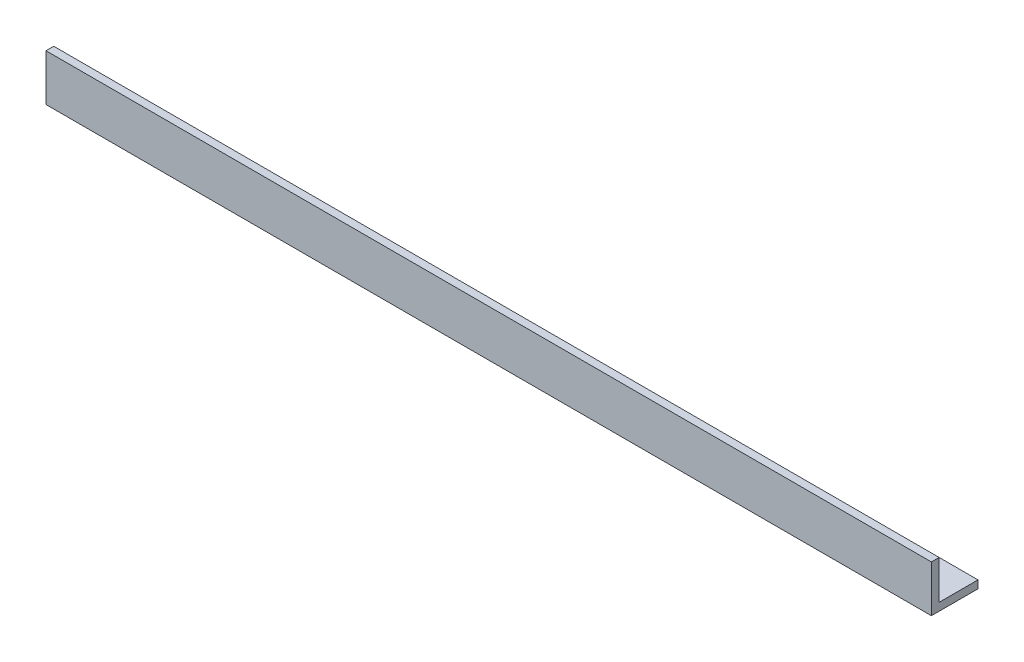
ISO-10303-21;
HEADER;
FILE_DESCRIPTION(('STEP AP214'),'2;1');
FILE_NAME('part.step','',(''),(''),'','','');
FILE_SCHEMA(('AUTOMOTIVE_DESIGN { 1 0 10303 214 1 1 1 1 }'));
ENDSEC;
DATA;
#1=APPLICATION_CONTEXT('core data for automotive mechanical design processes');
#2=APPLICATION_PROTOCOL_DEFINITION('international standard','automotive_design',2000,#1);
#3=PRODUCT_CONTEXT('',#1,'mechanical');
#4=PRODUCT('Part','Part','',(#3));
#5=PRODUCT_RELATED_PRODUCT_CATEGORY('part','',(#4));
#6=PRODUCT_DEFINITION_FORMATION('','',#4);
#7=PRODUCT_DEFINITION_CONTEXT('part definition',#1,'design');
#8=PRODUCT_DEFINITION('design','',#6,#7);
#9=PRODUCT_DEFINITION_SHAPE('','',#8);
#10=(LENGTH_UNIT() NAMED_UNIT(*) SI_UNIT(.MILLI.,.METRE.));
#11=(NAMED_UNIT(*) PLANE_ANGLE_UNIT() SI_UNIT($,.RADIAN.));
#12=(NAMED_UNIT(*) SI_UNIT($,.STERADIAN.) SOLID_ANGLE_UNIT());
#13=UNCERTAINTY_MEASURE_WITH_UNIT(LENGTH_MEASURE(1.E-05),#10,'distance_accuracy_value','');
#14=(GEOMETRIC_REPRESENTATION_CONTEXT(3) GLOBAL_UNCERTAINTY_ASSIGNED_CONTEXT((#13)) GLOBAL_UNIT_ASSIGNED_CONTEXT((#10,
#11,#12)) REPRESENTATION_CONTEXT('',''));
#15=CARTESIAN_POINT('',(0.,0.,0.));
#16=DIRECTION('',(0.,0.,1.));
#17=DIRECTION('',(1.,0.,0.));
#18=AXIS2_PLACEMENT_3D('',#15,#16,#17);
#19=CARTESIAN_POINT('',(723.9,0.,0.));
#20=DIRECTION('',(0.,1.,0.));
#21=DIRECTION('',(0.,0.,1.));
#22=AXIS2_PLACEMENT_3D('',#19,#20,#21);
#23=PLANE('',#22);
#24=DIRECTION('',(0.,0.,-1.));
#25=VECTOR('',#24,1.);
#26=CARTESIAN_POINT('',(0.,0.,0.));
#27=LINE('',#26,#25);
#28=CARTESIAN_POINT('',(0.,0.,0.));
#29=VERTEX_POINT('',#28);
#30=CARTESIAN_POINT('',(0.,0.,-38.1));
#31=VERTEX_POINT('',#30);
#32=EDGE_CURVE('E117',#29,#31,#27,.T.);
#33=ORIENTED_EDGE('',*,*,#32,.T.);
#34=DIRECTION('',(-1.,0.,0.));
#35=VECTOR('',#34,1.);
#36=CARTESIAN_POINT('',(723.9,0.,-38.1));
#37=LINE('',#36,#35);
#38=CARTESIAN_POINT('',(723.9,0.,-38.1));
#39=VERTEX_POINT('',#38);
#40=EDGE_CURVE('E11',#39,#31,#37,.T.);
#41=ORIENTED_EDGE('',*,*,#40,.F.);
#42=DIRECTION('',(0.,0.,-1.));
#43=VECTOR('',#42,1.);
#44=CARTESIAN_POINT('',(723.9,0.,0.));
#45=LINE('',#44,#43);
#46=CARTESIAN_POINT('',(723.9,0.,0.));
#47=VERTEX_POINT('',#46);
#48=EDGE_CURVE('E127',#47,#39,#45,.T.);
#49=ORIENTED_EDGE('',*,*,#48,.F.);
#50=DIRECTION('',(-1.,0.,0.));
#51=VECTOR('',#50,1.);
#52=CARTESIAN_POINT('',(723.9,0.,0.));
#53=LINE('',#52,#51);
#54=EDGE_CURVE('E113',#47,#29,#53,.T.);
#55=ORIENTED_EDGE('',*,*,#54,.T.);
#56=EDGE_LOOP('',(#33,#41,#49,#55));
#57=FACE_BOUND('',#56,.T.);
#58=ADVANCED_FACE('F33',(#57),#23,.F.);
#59=CARTESIAN_POINT('',(723.9,0.,-38.1));
#60=DIRECTION('',(0.,0.,1.));
#61=DIRECTION('',(1.,0.,0.));
#62=AXIS2_PLACEMENT_3D('',#59,#60,#61);
#63=PLANE('',#62);
#64=DIRECTION('',(0.,1.,0.));
#65=VECTOR('',#64,1.);
#66=CARTESIAN_POINT('',(0.,0.,-38.1));
#67=LINE('',#66,#65);
#68=CARTESIAN_POINT('',(0.,6.35,-38.1));
#69=VERTEX_POINT('',#68);
#70=EDGE_CURVE('E120',#31,#69,#67,.T.);
#71=ORIENTED_EDGE('',*,*,#70,.T.);
#72=DIRECTION('',(-1.,0.,0.));
#73=VECTOR('',#72,1.);
#74=CARTESIAN_POINT('',(723.9,6.35,-38.1));
#75=LINE('',#74,#73);
#76=CARTESIAN_POINT('',(723.9,6.35,-38.1));
#77=VERTEX_POINT('',#76);
#78=EDGE_CURVE('E41',#77,#69,#75,.T.);
#79=ORIENTED_EDGE('',*,*,#78,.F.);
#80=DIRECTION('',(0.,1.,0.));
#81=VECTOR('',#80,1.);
#82=CARTESIAN_POINT('',(723.9,0.,-38.1));
#83=LINE('',#82,#81);
#84=EDGE_CURVE('E86',#39,#77,#83,.T.);
#85=ORIENTED_EDGE('',*,*,#84,.F.);
#86=ORIENTED_EDGE('',*,*,#40,.T.);
#87=EDGE_LOOP('',(#71,#79,#85,#86));
#88=FACE_BOUND('',#87,.T.);
#89=ADVANCED_FACE('F151',(#88),#63,.F.);
#90=CARTESIAN_POINT('',(723.9,6.35,-38.1));
#91=DIRECTION('',(0.,-1.,0.));
#92=DIRECTION('',(0.,0.,-1.));
#93=AXIS2_PLACEMENT_3D('',#90,#91,#92);
#94=PLANE('',#93);
#95=DIRECTION('',(0.,0.,1.));
#96=VECTOR('',#95,1.);
#97=CARTESIAN_POINT('',(0.,6.35,-38.1));
#98=LINE('',#97,#96);
#99=CARTESIAN_POINT('',(0.,6.35,-6.35000000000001));
#100=VERTEX_POINT('',#99);
#101=EDGE_CURVE('E122',#69,#100,#98,.T.);
#102=ORIENTED_EDGE('',*,*,#101,.T.);
#103=DIRECTION('',(-1.,0.,0.));
#104=VECTOR('',#103,1.);
#105=CARTESIAN_POINT('',(723.9,6.35,-6.35000000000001));
#106=LINE('',#105,#104);
#107=CARTESIAN_POINT('',(723.9,6.35,-6.35000000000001));
#108=VERTEX_POINT('',#107);
#109=EDGE_CURVE('E108',#108,#100,#106,.T.);
#110=ORIENTED_EDGE('',*,*,#109,.F.);
#111=DIRECTION('',(0.,0.,1.));
#112=VECTOR('',#111,1.);
#113=CARTESIAN_POINT('',(723.9,6.35,-38.1));
#114=LINE('',#113,#112);
#115=EDGE_CURVE('E99',#77,#108,#114,.T.);
#116=ORIENTED_EDGE('',*,*,#115,.F.);
#117=ORIENTED_EDGE('',*,*,#78,.T.);
#118=EDGE_LOOP('',(#102,#110,#116,#117));
#119=FACE_BOUND('',#118,.T.);
#120=ADVANCED_FACE('F133',(#119),#94,.F.);
#121=CARTESIAN_POINT('',(723.9,38.1,-6.35));
#122=DIRECTION('',(0.,0.,1.));
#123=DIRECTION('',(0.,-1.,0.));
#124=AXIS2_PLACEMENT_3D('',#121,#122,#123);
#125=PLANE('',#124);
#126=DIRECTION('',(0.,1.,0.));
#127=VECTOR('',#126,1.);
#128=CARTESIAN_POINT('',(0.,38.1,-6.35));
#129=LINE('',#128,#127);
#130=CARTESIAN_POINT('',(0.,38.1,-6.35));
#131=VERTEX_POINT('',#130);
#132=EDGE_CURVE('E107',#100,#131,#129,.T.);
#133=ORIENTED_EDGE('',*,*,#132,.T.);
#134=DIRECTION('',(-1.,0.,0.));
#135=VECTOR('',#134,1.);
#136=CARTESIAN_POINT('',(723.9,38.1,-6.35));
#137=LINE('',#136,#135);
#138=CARTESIAN_POINT('',(723.9,38.1,-6.35));
#139=VERTEX_POINT('',#138);
#140=EDGE_CURVE('E104',#139,#131,#137,.T.);
#141=ORIENTED_EDGE('',*,*,#140,.F.);
#142=DIRECTION('',(0.,1.,0.));
#143=VECTOR('',#142,1.);
#144=CARTESIAN_POINT('',(723.9,38.1,-6.35));
#145=LINE('',#144,#143);
#146=EDGE_CURVE('E93',#108,#139,#145,.T.);
#147=ORIENTED_EDGE('',*,*,#146,.F.);
#148=ORIENTED_EDGE('',*,*,#109,.T.);
#149=EDGE_LOOP('',(#133,#141,#147,#148));
#150=FACE_BOUND('',#149,.T.);
#151=ADVANCED_FACE('F105',(#150),#125,.F.);
#152=CARTESIAN_POINT('',(723.9,38.1,0.));
#153=DIRECTION('',(0.,-1.,0.));
#154=DIRECTION('',(0.,0.,-1.));
#155=AXIS2_PLACEMENT_3D('',#152,#153,#154);
#156=PLANE('',#155);
#157=DIRECTION('',(0.,0.,1.));
#158=VECTOR('',#157,1.);
#159=CARTESIAN_POINT('',(0.,38.1,0.));
#160=LINE('',#159,#158);
#161=CARTESIAN_POINT('',(0.,38.1,0.));
#162=VERTEX_POINT('',#161);
#163=EDGE_CURVE('E72',#131,#162,#160,.T.);
#164=ORIENTED_EDGE('',*,*,#163,.T.);
#165=DIRECTION('',(-1.,0.,0.));
#166=VECTOR('',#165,1.);
#167=CARTESIAN_POINT('',(723.9,38.1,0.));
#168=LINE('',#167,#166);
#169=CARTESIAN_POINT('',(723.9,38.1,0.));
#170=VERTEX_POINT('',#169);
#171=EDGE_CURVE('E109',#170,#162,#168,.T.);
#172=ORIENTED_EDGE('',*,*,#171,.F.);
#173=DIRECTION('',(0.,0.,1.));
#174=VECTOR('',#173,1.);
#175=CARTESIAN_POINT('',(723.9,38.1,0.));
#176=LINE('',#175,#174);
#177=EDGE_CURVE('E97',#139,#170,#176,.T.);
#178=ORIENTED_EDGE('',*,*,#177,.F.);
#179=ORIENTED_EDGE('',*,*,#140,.T.);
#180=EDGE_LOOP('',(#164,#172,#178,#179));
#181=FACE_BOUND('',#180,.T.);
#182=ADVANCED_FACE('F111',(#181),#156,.F.);
#183=CARTESIAN_POINT('',(723.9,0.,0.));
#184=DIRECTION('',(0.,0.,-1.));
#185=DIRECTION('',(-1.,0.,0.));
#186=AXIS2_PLACEMENT_3D('',#183,#184,#185);
#187=PLANE('',#186);
#188=DIRECTION('',(0.,-1.,0.));
#189=VECTOR('',#188,1.);
#190=CARTESIAN_POINT('',(0.,0.,0.));
#191=LINE('',#190,#189);
#192=EDGE_CURVE('E78',#162,#29,#191,.T.);
#193=ORIENTED_EDGE('',*,*,#192,.T.);
#194=ORIENTED_EDGE('',*,*,#54,.F.);
#195=DIRECTION('',(0.,-1.,0.));
#196=VECTOR('',#195,1.);
#197=CARTESIAN_POINT('',(723.9,0.,0.));
#198=LINE('',#197,#196);
#199=EDGE_CURVE('E49',#170,#47,#198,.T.);
#200=ORIENTED_EDGE('',*,*,#199,.F.);
#201=ORIENTED_EDGE('',*,*,#171,.T.);
#202=EDGE_LOOP('',(#193,#194,#200,#201));
#203=FACE_BOUND('',#202,.T.);
#204=ADVANCED_FACE('F140',(#203),#187,.F.);
#205=CARTESIAN_POINT('',(723.9,0.,0.));
#206=DIRECTION('',(1.,0.,0.));
#207=DIRECTION('',(0.,0.,-1.));
#208=AXIS2_PLACEMENT_3D('',#205,#206,#207);
#209=PLANE('',#208);
#210=ORIENTED_EDGE('',*,*,#48,.T.);
#211=ORIENTED_EDGE('',*,*,#84,.T.);
#212=ORIENTED_EDGE('',*,*,#115,.T.);
#213=ORIENTED_EDGE('',*,*,#146,.T.);
#214=ORIENTED_EDGE('',*,*,#177,.T.);
#215=ORIENTED_EDGE('',*,*,#199,.T.);
#216=EDGE_LOOP('',(#210,#211,#212,#213,#214,#215));
#217=FACE_BOUND('',#216,.T.);
#218=ADVANCED_FACE('F95',(#217),#209,.T.);
#219=CARTESIAN_POINT('',(0.,0.,0.));
#220=DIRECTION('',(1.,0.,0.));
#221=DIRECTION('',(0.,0.,-1.));
#222=AXIS2_PLACEMENT_3D('',#219,#220,#221);
#223=PLANE('',#222);
#224=ORIENTED_EDGE('',*,*,#32,.F.);
#225=ORIENTED_EDGE('',*,*,#192,.F.);
#226=ORIENTED_EDGE('',*,*,#163,.F.);
#227=ORIENTED_EDGE('',*,*,#132,.F.);
#228=ORIENTED_EDGE('',*,*,#101,.F.);
#229=ORIENTED_EDGE('',*,*,#70,.F.);
#230=EDGE_LOOP('',(#224,#225,#226,#227,#228,#229));
#231=FACE_BOUND('',#230,.T.);
#232=ADVANCED_FACE('F136',(#231),#223,.F.);
#233=CLOSED_SHELL('',(#58,#89,#120,#151,#182,#204,#218,#232));
#234=MANIFOLD_SOLID_BREP('B2',#233);
#235=ADVANCED_BREP_SHAPE_REPRESENTATION('',(#18,#234),#14);
#236=SHAPE_DEFINITION_REPRESENTATION(#9,#235);
ENDSEC;
END-ISO-10303-21;
